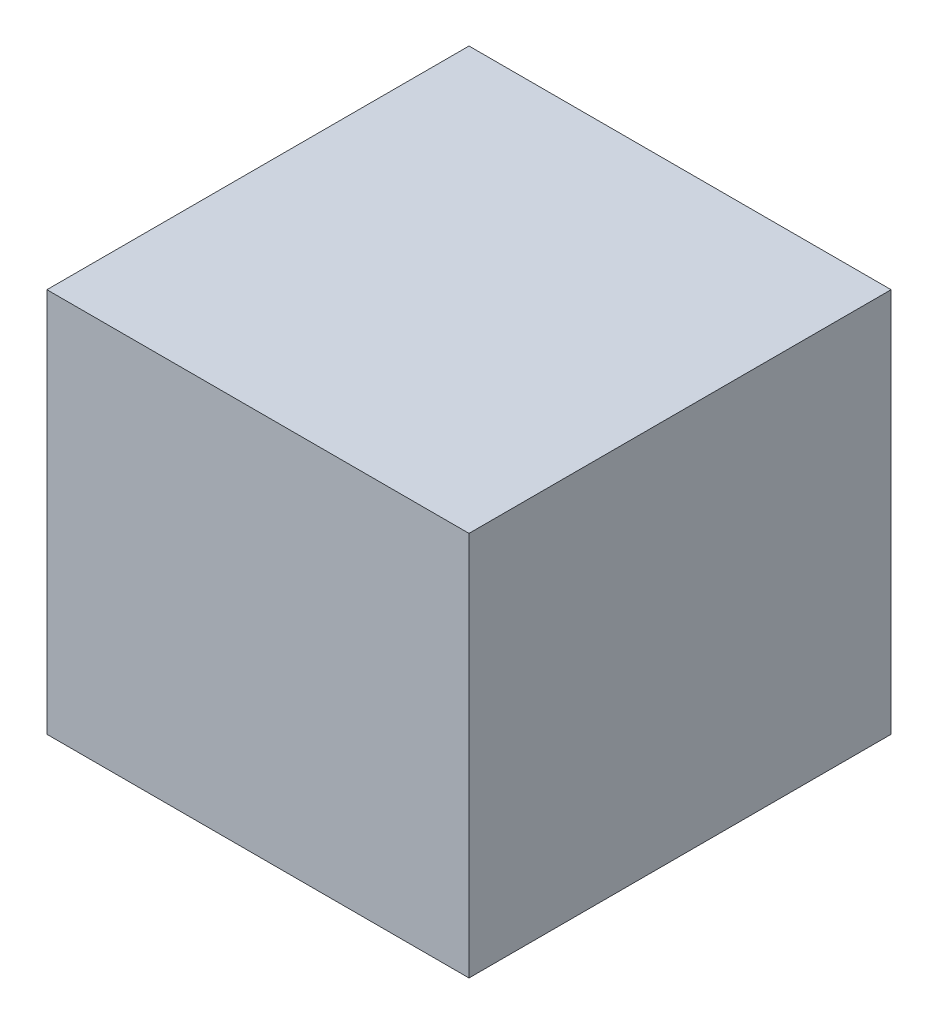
ISO-10303-21;
HEADER;
FILE_DESCRIPTION(('STEP AP214'),'2;1');
FILE_NAME('part.step','',(''),(''),'','','');
FILE_SCHEMA(('AUTOMOTIVE_DESIGN { 1 0 10303 214 1 1 1 1 }'));
ENDSEC;
DATA;
#1=APPLICATION_CONTEXT('core data for automotive mechanical design processes');
#2=APPLICATION_PROTOCOL_DEFINITION('international standard','automotive_design',2000,#1);
#3=PRODUCT_CONTEXT('',#1,'mechanical');
#4=PRODUCT('Part','Part','',(#3));
#5=PRODUCT_RELATED_PRODUCT_CATEGORY('part','',(#4));
#6=PRODUCT_DEFINITION_FORMATION('','',#4);
#7=PRODUCT_DEFINITION_CONTEXT('part definition',#1,'design');
#8=PRODUCT_DEFINITION('design','',#6,#7);
#9=PRODUCT_DEFINITION_SHAPE('','',#8);
#10=(LENGTH_UNIT() NAMED_UNIT(*) SI_UNIT(.MILLI.,.METRE.));
#11=(NAMED_UNIT(*) PLANE_ANGLE_UNIT() SI_UNIT($,.RADIAN.));
#12=(NAMED_UNIT(*) SI_UNIT($,.STERADIAN.) SOLID_ANGLE_UNIT());
#13=UNCERTAINTY_MEASURE_WITH_UNIT(LENGTH_MEASURE(1.E-05),#10,'distance_accuracy_value','');
#14=(GEOMETRIC_REPRESENTATION_CONTEXT(3) GLOBAL_UNCERTAINTY_ASSIGNED_CONTEXT((#13)) GLOBAL_UNIT_ASSIGNED_CONTEXT((#10,
#11,#12)) REPRESENTATION_CONTEXT('',''));
#15=CARTESIAN_POINT('',(0.,0.,0.));
#16=DIRECTION('',(0.,0.,1.));
#17=DIRECTION('',(1.,0.,0.));
#18=AXIS2_PLACEMENT_3D('',#15,#16,#17);
#19=CARTESIAN_POINT('',(0.,-52.,0.));
#20=DIRECTION('',(-1.,0.,0.));
#21=DIRECTION('',(0.,0.,1.));
#22=AXIS2_PLACEMENT_3D('',#19,#20,#21);
#23=PLANE('',#22);
#24=DIRECTION('',(0.,0.,1.));
#25=VECTOR('',#24,1.);
#26=CARTESIAN_POINT('',(0.,0.,0.));
#27=LINE('',#26,#25);
#28=CARTESIAN_POINT('',(0.,0.,-57.));
#29=VERTEX_POINT('',#28);
#30=CARTESIAN_POINT('',(0.,0.,0.));
#31=VERTEX_POINT('',#30);
#32=EDGE_CURVE('E111',#29,#31,#27,.T.);
#33=ORIENTED_EDGE('',*,*,#32,.F.);
#34=DIRECTION('',(0.,1.,0.));
#35=VECTOR('',#34,1.);
#36=CARTESIAN_POINT('',(0.,-52.,-57.));
#37=LINE('',#36,#35);
#38=CARTESIAN_POINT('',(0.,-52.,-57.));
#39=VERTEX_POINT('',#38);
#40=EDGE_CURVE('E11',#39,#29,#37,.T.);
#41=ORIENTED_EDGE('',*,*,#40,.F.);
#42=DIRECTION('',(0.,0.,1.));
#43=VECTOR('',#42,1.);
#44=CARTESIAN_POINT('',(0.,-52.,0.));
#45=LINE('',#44,#43);
#46=CARTESIAN_POINT('',(0.,-52.,0.));
#47=VERTEX_POINT('',#46);
#48=EDGE_CURVE('E103',#39,#47,#45,.T.);
#49=ORIENTED_EDGE('',*,*,#48,.T.);
#50=DIRECTION('',(0.,1.,0.));
#51=VECTOR('',#50,1.);
#52=CARTESIAN_POINT('',(0.,-52.,0.));
#53=LINE('',#52,#51);
#54=EDGE_CURVE('E44',#47,#31,#53,.T.);
#55=ORIENTED_EDGE('',*,*,#54,.T.);
#56=EDGE_LOOP('',(#33,#41,#49,#55));
#57=FACE_BOUND('',#56,.T.);
#58=ADVANCED_FACE('F41',(#57),#23,.T.);
#59=CARTESIAN_POINT('',(0.,-52.,-57.));
#60=DIRECTION('',(0.,0.,-1.));
#61=DIRECTION('',(-1.,0.,0.));
#62=AXIS2_PLACEMENT_3D('',#59,#60,#61);
#63=PLANE('',#62);
#64=DIRECTION('',(-1.,0.,0.));
#65=VECTOR('',#64,1.);
#66=CARTESIAN_POINT('',(0.,0.,-57.));
#67=LINE('',#66,#65);
#68=CARTESIAN_POINT('',(57.,0.,-57.));
#69=VERTEX_POINT('',#68);
#70=EDGE_CURVE('E106',#69,#29,#67,.T.);
#71=ORIENTED_EDGE('',*,*,#70,.F.);
#72=DIRECTION('',(0.,1.,0.));
#73=VECTOR('',#72,1.);
#74=CARTESIAN_POINT('',(57.,-52.,-57.));
#75=LINE('',#74,#73);
#76=CARTESIAN_POINT('',(57.,-52.,-57.));
#77=VERTEX_POINT('',#76);
#78=EDGE_CURVE('E51',#77,#69,#75,.T.);
#79=ORIENTED_EDGE('',*,*,#78,.F.);
#80=DIRECTION('',(-1.,0.,0.));
#81=VECTOR('',#80,1.);
#82=CARTESIAN_POINT('',(0.,-52.,-57.));
#83=LINE('',#82,#81);
#84=EDGE_CURVE('E98',#77,#39,#83,.T.);
#85=ORIENTED_EDGE('',*,*,#84,.T.);
#86=ORIENTED_EDGE('',*,*,#40,.T.);
#87=EDGE_LOOP('',(#71,#79,#85,#86));
#88=FACE_BOUND('',#87,.T.);
#89=ADVANCED_FACE('F127',(#88),#63,.T.);
#90=CARTESIAN_POINT('',(57.,-52.,0.));
#91=DIRECTION('',(1.,0.,0.));
#92=DIRECTION('',(0.,0.,-1.));
#93=AXIS2_PLACEMENT_3D('',#90,#91,#92);
#94=PLANE('',#93);
#95=DIRECTION('',(0.,0.,-1.));
#96=VECTOR('',#95,1.);
#97=CARTESIAN_POINT('',(57.,0.,0.));
#98=LINE('',#97,#96);
#99=CARTESIAN_POINT('',(57.,0.,0.));
#100=VERTEX_POINT('',#99);
#101=EDGE_CURVE('E92',#100,#69,#98,.T.);
#102=ORIENTED_EDGE('',*,*,#101,.F.);
#103=DIRECTION('',(0.,1.,0.));
#104=VECTOR('',#103,1.);
#105=CARTESIAN_POINT('',(57.,-52.,0.));
#106=LINE('',#105,#104);
#107=CARTESIAN_POINT('',(57.,-52.,0.));
#108=VERTEX_POINT('',#107);
#109=EDGE_CURVE('E87',#108,#100,#106,.T.);
#110=ORIENTED_EDGE('',*,*,#109,.F.);
#111=DIRECTION('',(0.,0.,-1.));
#112=VECTOR('',#111,1.);
#113=CARTESIAN_POINT('',(57.,-52.,0.));
#114=LINE('',#113,#112);
#115=EDGE_CURVE('E90',#108,#77,#114,.T.);
#116=ORIENTED_EDGE('',*,*,#115,.T.);
#117=ORIENTED_EDGE('',*,*,#78,.T.);
#118=EDGE_LOOP('',(#102,#110,#116,#117));
#119=FACE_BOUND('',#118,.T.);
#120=ADVANCED_FACE('F89',(#119),#94,.T.);
#121=CARTESIAN_POINT('',(0.,-52.,0.));
#122=DIRECTION('',(0.,0.,1.));
#123=DIRECTION('',(1.,0.,0.));
#124=AXIS2_PLACEMENT_3D('',#121,#122,#123);
#125=PLANE('',#124);
#126=DIRECTION('',(1.,0.,0.));
#127=VECTOR('',#126,1.);
#128=CARTESIAN_POINT('',(0.,0.,0.));
#129=LINE('',#128,#127);
#130=EDGE_CURVE('E115',#31,#100,#129,.T.);
#131=ORIENTED_EDGE('',*,*,#130,.F.);
#132=ORIENTED_EDGE('',*,*,#54,.F.);
#133=DIRECTION('',(1.,0.,0.));
#134=VECTOR('',#133,1.);
#135=CARTESIAN_POINT('',(0.,-52.,0.));
#136=LINE('',#135,#134);
#137=EDGE_CURVE('E97',#47,#108,#136,.T.);
#138=ORIENTED_EDGE('',*,*,#137,.T.);
#139=ORIENTED_EDGE('',*,*,#109,.T.);
#140=EDGE_LOOP('',(#131,#132,#138,#139));
#141=FACE_BOUND('',#140,.T.);
#142=ADVANCED_FACE('F101',(#141),#125,.T.);
#143=CARTESIAN_POINT('',(0.,-52.,-57.));
#144=DIRECTION('',(0.,-1.,0.));
#145=DIRECTION('',(0.,0.,-1.));
#146=AXIS2_PLACEMENT_3D('',#143,#144,#145);
#147=PLANE('',#146);
#148=ORIENTED_EDGE('',*,*,#48,.F.);
#149=ORIENTED_EDGE('',*,*,#84,.F.);
#150=ORIENTED_EDGE('',*,*,#115,.F.);
#151=ORIENTED_EDGE('',*,*,#137,.F.);
#152=EDGE_LOOP('',(#148,#149,#150,#151));
#153=FACE_BOUND('',#152,.T.);
#154=ADVANCED_FACE('F96',(#153),#147,.T.);
#155=CARTESIAN_POINT('',(0.,0.,-57.));
#156=DIRECTION('',(0.,-1.,0.));
#157=DIRECTION('',(0.,0.,-1.));
#158=AXIS2_PLACEMENT_3D('',#155,#156,#157);
#159=PLANE('',#158);
#160=ORIENTED_EDGE('',*,*,#32,.T.);
#161=ORIENTED_EDGE('',*,*,#130,.T.);
#162=ORIENTED_EDGE('',*,*,#101,.T.);
#163=ORIENTED_EDGE('',*,*,#70,.T.);
#164=EDGE_LOOP('',(#160,#161,#162,#163));
#165=FACE_BOUND('',#164,.T.);
#166=ADVANCED_FACE('F126',(#165),#159,.F.);
#167=CLOSED_SHELL('',(#58,#89,#120,#142,#154,#166));
#168=MANIFOLD_SOLID_BREP('B2',#167);
#169=ADVANCED_BREP_SHAPE_REPRESENTATION('',(#18,#168),#14);
#170=SHAPE_DEFINITION_REPRESENTATION(#9,#169);
ENDSEC;
END-ISO-10303-21;
